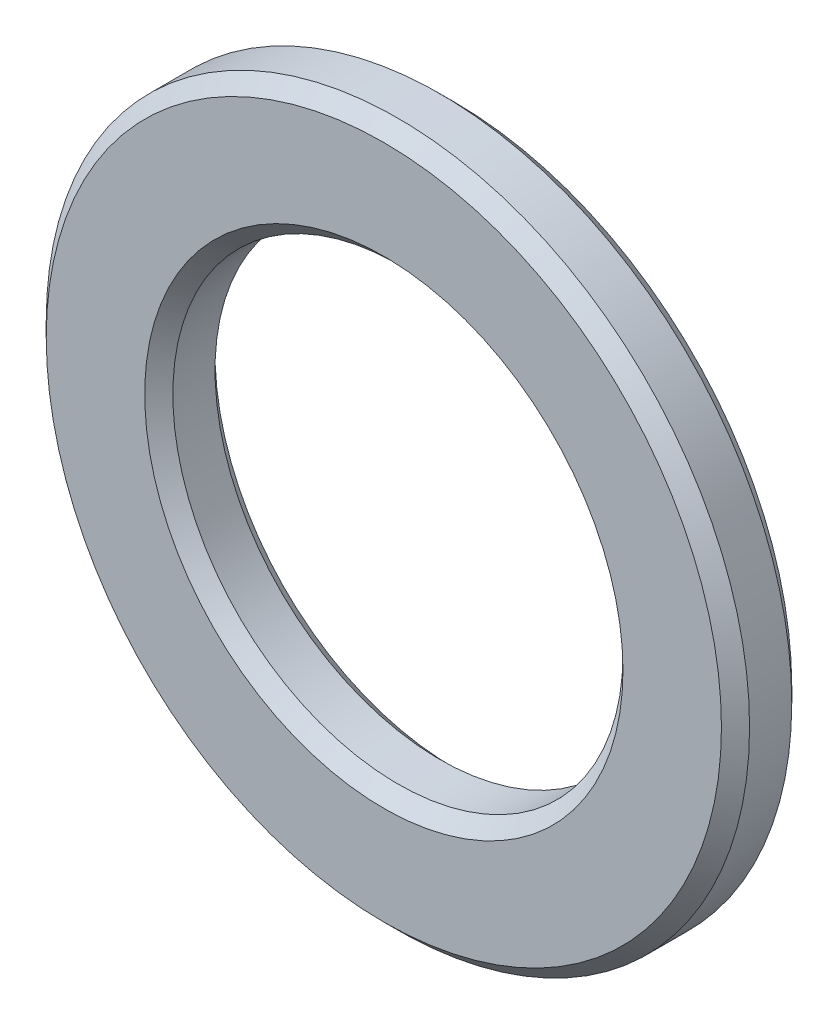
ISO-10303-21;
HEADER;
FILE_DESCRIPTION(('STEP AP214'),'2;1');
FILE_NAME('part.step','',(''),(''),'','','');
FILE_SCHEMA(('AUTOMOTIVE_DESIGN { 1 0 10303 214 1 1 1 1 }'));
ENDSEC;
DATA;
#1=APPLICATION_CONTEXT('core data for automotive mechanical design processes');
#2=APPLICATION_PROTOCOL_DEFINITION('international standard','automotive_design',2000,#1);
#3=PRODUCT_CONTEXT('',#1,'mechanical');
#4=PRODUCT('Part','Part','',(#3));
#5=PRODUCT_RELATED_PRODUCT_CATEGORY('part','',(#4));
#6=PRODUCT_DEFINITION_FORMATION('','',#4);
#7=PRODUCT_DEFINITION_CONTEXT('part definition',#1,'design');
#8=PRODUCT_DEFINITION('design','',#6,#7);
#9=PRODUCT_DEFINITION_SHAPE('','',#8);
#10=(LENGTH_UNIT() NAMED_UNIT(*) SI_UNIT(.MILLI.,.METRE.));
#11=(NAMED_UNIT(*) PLANE_ANGLE_UNIT() SI_UNIT($,.RADIAN.));
#12=(NAMED_UNIT(*) SI_UNIT($,.STERADIAN.) SOLID_ANGLE_UNIT());
#13=UNCERTAINTY_MEASURE_WITH_UNIT(LENGTH_MEASURE(1.E-05),#10,'distance_accuracy_value','');
#14=(GEOMETRIC_REPRESENTATION_CONTEXT(3) GLOBAL_UNCERTAINTY_ASSIGNED_CONTEXT((#13)) GLOBAL_UNIT_ASSIGNED_CONTEXT((#10,
#11,#12)) REPRESENTATION_CONTEXT('',''));
#15=CARTESIAN_POINT('',(0.,0.,0.));
#16=DIRECTION('',(0.,0.,1.));
#17=DIRECTION('',(1.,0.,0.));
#18=AXIS2_PLACEMENT_3D('',#15,#16,#17);
#19=CARTESIAN_POINT('',(0.,0.,0.5));
#20=DIRECTION('',(0.,0.,1.));
#21=DIRECTION('',(1.,0.,0.));
#22=AXIS2_PLACEMENT_3D('',#19,#20,#21);
#23=PLANE('',#22);
#24=CARTESIAN_POINT('',(0.,0.,0.5));
#25=DIRECTION('',(0.,0.,1.));
#26=DIRECTION('',(1.,0.,0.));
#27=AXIS2_PLACEMENT_3D('',#24,#25,#26);
#28=CIRCLE('',#27,3.4);
#29=CARTESIAN_POINT('',(3.4,0.,0.5));
#30=VERTEX_POINT('',#29);
#31=EDGE_CURVE('E10',#30,#30,#28,.F.);
#32=ORIENTED_EDGE('',*,*,#31,.T.);
#33=EDGE_LOOP('',(#32));
#34=FACE_BOUND('',#33,.T.);
#35=CARTESIAN_POINT('',(0.,0.,0.5));
#36=DIRECTION('',(0.,0.,1.));
#37=DIRECTION('',(1.,0.,0.));
#38=AXIS2_PLACEMENT_3D('',#35,#36,#37);
#39=CIRCLE('',#38,4.8);
#40=CARTESIAN_POINT('',(4.8,0.,0.5));
#41=VERTEX_POINT('',#40);
#42=EDGE_CURVE('E45',#41,#41,#39,.T.);
#43=ORIENTED_EDGE('',*,*,#42,.T.);
#44=EDGE_LOOP('',(#43));
#45=FACE_BOUND('',#44,.T.);
#46=ADVANCED_FACE('F37',(#34,#45),#23,.T.);
#47=CARTESIAN_POINT('',(0.,0.,-0.5));
#48=DIRECTION('',(0.,0.,1.));
#49=DIRECTION('',(1.,0.,0.));
#50=AXIS2_PLACEMENT_3D('',#47,#48,#49);
#51=PLANE('',#50);
#52=CARTESIAN_POINT('',(0.,0.,-0.5));
#53=DIRECTION('',(0.,0.,1.));
#54=DIRECTION('',(1.,0.,0.));
#55=AXIS2_PLACEMENT_3D('',#52,#53,#54);
#56=CIRCLE('',#55,4.8);
#57=CARTESIAN_POINT('',(4.8,0.,-0.5));
#58=VERTEX_POINT('',#57);
#59=EDGE_CURVE('E63',#58,#58,#56,.F.);
#60=ORIENTED_EDGE('',*,*,#59,.T.);
#61=EDGE_LOOP('',(#60));
#62=FACE_BOUND('',#61,.T.);
#63=CARTESIAN_POINT('',(0.,0.,-0.5));
#64=DIRECTION('',(0.,0.,1.));
#65=DIRECTION('',(1.,0.,0.));
#66=AXIS2_PLACEMENT_3D('',#63,#64,#65);
#67=CIRCLE('',#66,3.4);
#68=CARTESIAN_POINT('',(3.4,0.,-0.5));
#69=VERTEX_POINT('',#68);
#70=EDGE_CURVE('E67',#69,#69,#67,.T.);
#71=ORIENTED_EDGE('',*,*,#70,.T.);
#72=EDGE_LOOP('',(#71));
#73=FACE_BOUND('',#72,.T.);
#74=ADVANCED_FACE('F89',(#62,#73),#51,.F.);
#75=CARTESIAN_POINT('',(0.,0.,0.5));
#76=DIRECTION('',(0.,0.,-1.));
#77=DIRECTION('',(-1.,0.,0.));
#78=AXIS2_PLACEMENT_3D('',#75,#76,#77);
#79=CYLINDRICAL_SURFACE('',#78,5.);
#80=CARTESIAN_POINT('',(0.,0.,-0.3));
#81=DIRECTION('',(0.,0.,1.));
#82=DIRECTION('',(1.,0.,0.));
#83=AXIS2_PLACEMENT_3D('',#80,#81,#82);
#84=CIRCLE('',#83,5.);
#85=CARTESIAN_POINT('',(5.,0.,-0.3));
#86=VERTEX_POINT('',#85);
#87=EDGE_CURVE('E71',#86,#86,#84,.T.);
#88=ORIENTED_EDGE('',*,*,#87,.T.);
#89=EDGE_LOOP('',(#88));
#90=FACE_BOUND('',#89,.T.);
#91=CARTESIAN_POINT('',(0.,0.,0.299999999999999));
#92=DIRECTION('',(0.,0.,1.));
#93=DIRECTION('',(1.,0.,0.));
#94=AXIS2_PLACEMENT_3D('',#91,#92,#93);
#95=CIRCLE('',#94,5.);
#96=CARTESIAN_POINT('',(5.,0.,0.299999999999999));
#97=VERTEX_POINT('',#96);
#98=EDGE_CURVE('E74',#97,#97,#95,.F.);
#99=ORIENTED_EDGE('',*,*,#98,.T.);
#100=EDGE_LOOP('',(#99));
#101=FACE_BOUND('',#100,.T.);
#102=ADVANCED_FACE('F78',(#90,#101),#79,.T.);
#103=CARTESIAN_POINT('',(0.,0.,0.5));
#104=DIRECTION('',(0.,0.,-1.));
#105=DIRECTION('',(-1.,0.,0.));
#106=AXIS2_PLACEMENT_3D('',#103,#104,#105);
#107=CYLINDRICAL_SURFACE('',#106,3.2);
#108=CARTESIAN_POINT('',(0.,0.,-0.299999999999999));
#109=DIRECTION('',(0.,0.,1.));
#110=DIRECTION('',(1.,0.,0.));
#111=AXIS2_PLACEMENT_3D('',#108,#109,#110);
#112=CIRCLE('',#111,3.2);
#113=CARTESIAN_POINT('',(3.2,0.,-0.299999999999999));
#114=VERTEX_POINT('',#113);
#115=EDGE_CURVE('E52',#114,#114,#112,.F.);
#116=ORIENTED_EDGE('',*,*,#115,.T.);
#117=EDGE_LOOP('',(#116));
#118=FACE_BOUND('',#117,.T.);
#119=CARTESIAN_POINT('',(0.,0.,0.299999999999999));
#120=DIRECTION('',(0.,0.,1.));
#121=DIRECTION('',(1.,0.,0.));
#122=AXIS2_PLACEMENT_3D('',#119,#120,#121);
#123=CIRCLE('',#122,3.2);
#124=CARTESIAN_POINT('',(3.2,0.,0.299999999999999));
#125=VERTEX_POINT('',#124);
#126=EDGE_CURVE('E58',#125,#125,#123,.T.);
#127=ORIENTED_EDGE('',*,*,#126,.T.);
#128=EDGE_LOOP('',(#127));
#129=FACE_BOUND('',#128,.T.);
#130=ADVANCED_FACE('F97',(#118,#129),#107,.F.);
#131=CARTESIAN_POINT('',(0.,0.,-0.3));
#132=DIRECTION('',(0.,0.,1.));
#133=DIRECTION('',(1.,0.,0.));
#134=AXIS2_PLACEMENT_3D('',#131,#132,#133);
#135=CONICAL_SURFACE('',#134,5.,0.78539816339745);
#136=CARTESIAN_POINT('',(4.8,0.,-0.5));
#137=CARTESIAN_POINT('',(4.80208333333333,0.,-0.497916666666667));
#138=CARTESIAN_POINT('',(4.80416666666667,0.,-0.495833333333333));
#139=CARTESIAN_POINT('',(4.80833333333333,0.,-0.491666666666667));
#140=CARTESIAN_POINT('',(4.81041666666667,0.,-0.489583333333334));
#141=CARTESIAN_POINT('',(4.81458333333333,0.,-0.485416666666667));
#142=CARTESIAN_POINT('',(4.81666666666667,0.,-0.483333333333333));
#143=CARTESIAN_POINT('',(4.82083333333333,0.,-0.479166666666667));
#144=CARTESIAN_POINT('',(4.82291666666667,0.,-0.477083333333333));
#145=CARTESIAN_POINT('',(4.82708333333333,0.,-0.472916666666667));
#146=CARTESIAN_POINT('',(4.82916666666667,0.,-0.470833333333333));
#147=CARTESIAN_POINT('',(4.83333333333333,0.,-0.466666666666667));
#148=CARTESIAN_POINT('',(4.83541666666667,0.,-0.464583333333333));
#149=CARTESIAN_POINT('',(4.83958333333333,0.,-0.460416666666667));
#150=CARTESIAN_POINT('',(4.84166666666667,0.,-0.458333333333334));
#151=CARTESIAN_POINT('',(4.84583333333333,0.,-0.454166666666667));
#152=CARTESIAN_POINT('',(4.84791666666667,0.,-0.452083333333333));
#153=CARTESIAN_POINT('',(4.85208333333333,0.,-0.447916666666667));
#154=CARTESIAN_POINT('',(4.85416666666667,0.,-0.445833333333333));
#155=CARTESIAN_POINT('',(4.85833333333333,0.,-0.441666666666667));
#156=CARTESIAN_POINT('',(4.86041666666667,0.,-0.439583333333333));
#157=CARTESIAN_POINT('',(4.86458333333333,0.,-0.435416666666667));
#158=CARTESIAN_POINT('',(4.86666666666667,0.,-0.433333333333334));
#159=CARTESIAN_POINT('',(4.87083333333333,0.,-0.429166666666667));
#160=CARTESIAN_POINT('',(4.87291666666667,0.,-0.427083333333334));
#161=CARTESIAN_POINT('',(4.87708333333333,0.,-0.422916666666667));
#162=CARTESIAN_POINT('',(4.87916666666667,0.,-0.420833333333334));
#163=CARTESIAN_POINT('',(4.88333333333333,0.,-0.416666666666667));
#164=CARTESIAN_POINT('',(4.88541666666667,0.,-0.414583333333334));
#165=CARTESIAN_POINT('',(4.88958333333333,0.,-0.410416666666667));
#166=CARTESIAN_POINT('',(4.89166666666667,0.,-0.408333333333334));
#167=CARTESIAN_POINT('',(4.89583333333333,0.,-0.404166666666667));
#168=CARTESIAN_POINT('',(4.89791666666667,0.,-0.402083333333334));
#169=CARTESIAN_POINT('',(4.90208333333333,0.,-0.397916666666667));
#170=CARTESIAN_POINT('',(4.90416666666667,0.,-0.395833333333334));
#171=CARTESIAN_POINT('',(4.90833333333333,0.,-0.391666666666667));
#172=CARTESIAN_POINT('',(4.91041666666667,0.,-0.389583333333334));
#173=CARTESIAN_POINT('',(4.91458333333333,0.,-0.385416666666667));
#174=CARTESIAN_POINT('',(4.91666666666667,0.,-0.383333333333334));
#175=CARTESIAN_POINT('',(4.92083333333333,0.,-0.379166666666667));
#176=CARTESIAN_POINT('',(4.92291666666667,0.,-0.377083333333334));
#177=CARTESIAN_POINT('',(4.92708333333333,0.,-0.372916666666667));
#178=CARTESIAN_POINT('',(4.92916666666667,0.,-0.370833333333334));
#179=CARTESIAN_POINT('',(4.93333333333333,0.,-0.366666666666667));
#180=CARTESIAN_POINT('',(4.93541666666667,0.,-0.364583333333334));
#181=CARTESIAN_POINT('',(4.93958333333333,0.,-0.360416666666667));
#182=CARTESIAN_POINT('',(4.94166666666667,0.,-0.358333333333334));
#183=CARTESIAN_POINT('',(4.94583333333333,0.,-0.354166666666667));
#184=CARTESIAN_POINT('',(4.94791666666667,0.,-0.352083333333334));
#185=CARTESIAN_POINT('',(4.95208333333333,0.,-0.347916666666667));
#186=CARTESIAN_POINT('',(4.95416666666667,0.,-0.345833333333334));
#187=CARTESIAN_POINT('',(4.95833333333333,0.,-0.341666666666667));
#188=CARTESIAN_POINT('',(4.96041666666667,0.,-0.339583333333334));
#189=CARTESIAN_POINT('',(4.96458333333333,0.,-0.335416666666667));
#190=CARTESIAN_POINT('',(4.96666666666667,0.,-0.333333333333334));
#191=CARTESIAN_POINT('',(4.97083333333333,0.,-0.329166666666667));
#192=CARTESIAN_POINT('',(4.97291666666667,0.,-0.327083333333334));
#193=CARTESIAN_POINT('',(4.97708333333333,0.,-0.322916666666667));
#194=CARTESIAN_POINT('',(4.97916666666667,0.,-0.320833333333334));
#195=CARTESIAN_POINT('',(4.98333333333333,0.,-0.316666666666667));
#196=CARTESIAN_POINT('',(4.98541666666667,0.,-0.314583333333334));
#197=CARTESIAN_POINT('',(4.98958333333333,0.,-0.310416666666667));
#198=CARTESIAN_POINT('',(4.99166666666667,0.,-0.308333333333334));
#199=CARTESIAN_POINT('',(4.99583333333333,0.,-0.304166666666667));
#200=CARTESIAN_POINT('',(4.99791666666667,0.,-0.302083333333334));
#201=CARTESIAN_POINT('',(5.,0.,-0.3));
#202=B_SPLINE_CURVE_WITH_KNOTS('',3,(#136,#137,#138,#139,#140,#141,#142,#143,#144,#145,#146,
#147,#148,#149,#150,#151,#152,#153,#154,#155,#156,#157,#158,#159,#160,#161,#162,#163,#164,#165,
#166,#167,#168,#169,#170,#171,#172,#173,#174,#175,#176,#177,#178,#179,#180,#181,#182,#183,#184,
#185,#186,#187,#188,#189,#190,#191,#192,#193,#194,#195,#196,#197,#198,#199,#200,#201),
.UNSPECIFIED.,.F.,.F.,(4,2,2,2,2,2,2,2,2,2,2,2,2,2,2,2,2,2,2,2,2,2,2,2,2,2,2,2,2,2,2,2,4),(0.,
0.00883883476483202,0.017677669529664,0.0265165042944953,0.0353553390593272,0.0441941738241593,
0.0530330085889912,0.0618718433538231,0.0707106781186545,0.0795495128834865,0.0883883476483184,
0.0972271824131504,0.106066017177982,0.114904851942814,0.123743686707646,0.132582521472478,
0.14142135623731,0.150260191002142,0.159099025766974,0.167937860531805,0.176776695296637,
0.185615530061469,0.194454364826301,0.203293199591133,0.212132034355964,0.220970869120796,
0.229809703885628,0.23864853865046,0.247487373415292,0.256326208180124,0.265165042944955,
0.274003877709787,0.282842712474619),.UNSPECIFIED.);
#203=EDGE_CURVE('BSEAM102',#58,#86,#202,.T.);
#204=ORIENTED_EDGE('',*,*,#59,.F.);
#205=ORIENTED_EDGE('',*,*,#87,.F.);
#206=ORIENTED_EDGE('',*,*,#203,.T.);
#207=ORIENTED_EDGE('',*,*,#203,.F.);
#208=EDGE_LOOP('',(#204,#206,#205,#207));
#209=FACE_BOUND('',#208,.T.);
#210=ADVANCED_FACE('F102',(#209),#135,.T.);
#211=CARTESIAN_POINT('',(0.,0.,-0.5));
#212=DIRECTION('',(0.,0.,-1.));
#213=DIRECTION('',(-1.,0.,0.));
#214=AXIS2_PLACEMENT_3D('',#211,#212,#213);
#215=CONICAL_SURFACE('',#214,3.4,0.785398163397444);
#216=ORIENTED_EDGE('',*,*,#115,.F.);
#217=EDGE_LOOP('',(#216));
#218=FACE_BOUND('',#217,.T.);
#219=ORIENTED_EDGE('',*,*,#70,.F.);
#220=EDGE_LOOP('',(#219));
#221=FACE_BOUND('',#220,.T.);
#222=ADVANCED_FACE('F86',(#218,#221),#215,.F.);
#223=CARTESIAN_POINT('',(0.,0.,0.299999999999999));
#224=DIRECTION('',(0.,0.,1.));
#225=DIRECTION('',(1.,0.,0.));
#226=AXIS2_PLACEMENT_3D('',#223,#224,#225);
#227=CONICAL_SURFACE('',#226,3.2,0.785398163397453);
#228=ORIENTED_EDGE('',*,*,#31,.F.);
#229=EDGE_LOOP('',(#228));
#230=FACE_BOUND('',#229,.T.);
#231=ORIENTED_EDGE('',*,*,#126,.F.);
#232=EDGE_LOOP('',(#231));
#233=FACE_BOUND('',#232,.T.);
#234=ADVANCED_FACE('F82',(#230,#233),#227,.F.);
#235=CARTESIAN_POINT('',(0.,0.,0.5));
#236=DIRECTION('',(0.,0.,-1.));
#237=DIRECTION('',(-1.,0.,0.));
#238=AXIS2_PLACEMENT_3D('',#235,#236,#237);
#239=CONICAL_SURFACE('',#238,4.8,0.785398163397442);
#240=ORIENTED_EDGE('',*,*,#98,.F.);
#241=EDGE_LOOP('',(#240));
#242=FACE_BOUND('',#241,.T.);
#243=ORIENTED_EDGE('',*,*,#42,.F.);
#244=EDGE_LOOP('',(#243));
#245=FACE_BOUND('',#244,.T.);
#246=ADVANCED_FACE('F39',(#242,#245),#239,.T.);
#247=CLOSED_SHELL('',(#46,#74,#102,#130,#210,#222,#234,#246));
#248=MANIFOLD_SOLID_BREP('B2',#247);
#249=ADVANCED_BREP_SHAPE_REPRESENTATION('',(#18,#248),#14);
#250=SHAPE_DEFINITION_REPRESENTATION(#9,#249);
ENDSEC;
END-ISO-10303-21;
